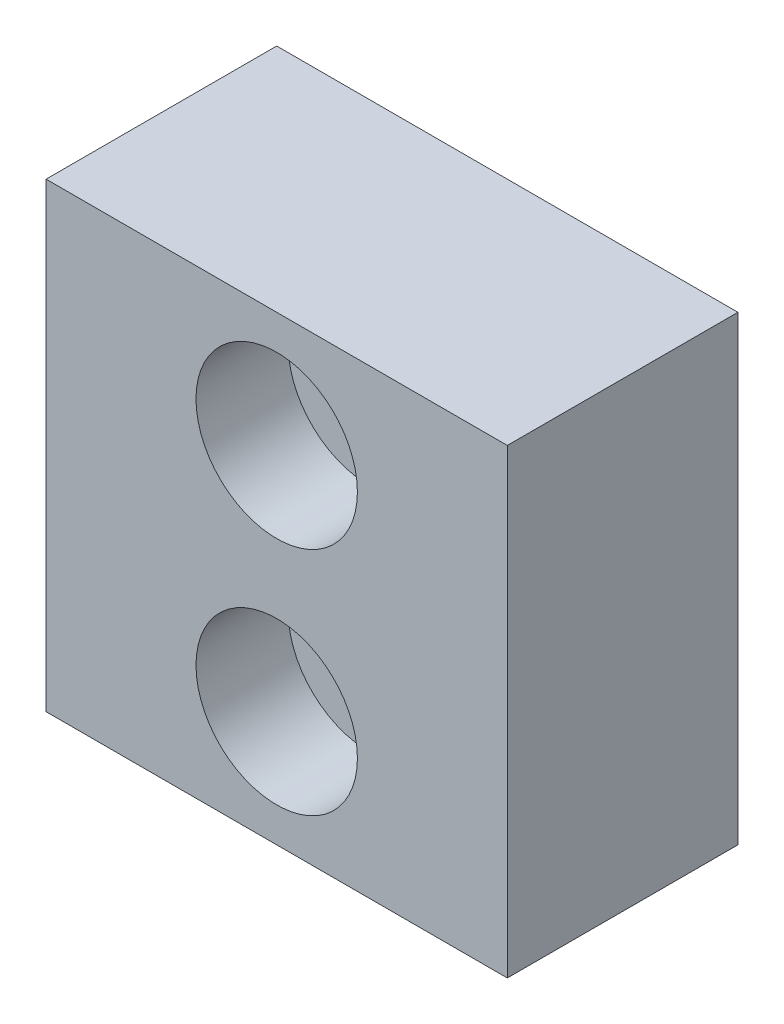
ISO-10303-21;
HEADER;
FILE_DESCRIPTION(('STEP AP214'),'2;1');
FILE_NAME('part.step','',(''),(''),'','','');
FILE_SCHEMA(('AUTOMOTIVE_DESIGN { 1 0 10303 214 1 1 1 1 }'));
ENDSEC;
DATA;
#1=APPLICATION_CONTEXT('core data for automotive mechanical design processes');
#2=APPLICATION_PROTOCOL_DEFINITION('international standard','automotive_design',2000,#1);
#3=PRODUCT_CONTEXT('',#1,'mechanical');
#4=PRODUCT('Part','Part','',(#3));
#5=PRODUCT_RELATED_PRODUCT_CATEGORY('part','',(#4));
#6=PRODUCT_DEFINITION_FORMATION('','',#4);
#7=PRODUCT_DEFINITION_CONTEXT('part definition',#1,'design');
#8=PRODUCT_DEFINITION('design','',#6,#7);
#9=PRODUCT_DEFINITION_SHAPE('','',#8);
#10=(LENGTH_UNIT() NAMED_UNIT(*) SI_UNIT(.MILLI.,.METRE.));
#11=(NAMED_UNIT(*) PLANE_ANGLE_UNIT() SI_UNIT($,.RADIAN.));
#12=(NAMED_UNIT(*) SI_UNIT($,.STERADIAN.) SOLID_ANGLE_UNIT());
#13=UNCERTAINTY_MEASURE_WITH_UNIT(LENGTH_MEASURE(1.E-05),#10,'distance_accuracy_value','');
#14=(GEOMETRIC_REPRESENTATION_CONTEXT(3) GLOBAL_UNCERTAINTY_ASSIGNED_CONTEXT((#13)) GLOBAL_UNIT_ASSIGNED_CONTEXT((#10,
#11,#12)) REPRESENTATION_CONTEXT('',''));
#15=CARTESIAN_POINT('',(0.,0.,0.));
#16=DIRECTION('',(0.,0.,1.));
#17=DIRECTION('',(1.,0.,0.));
#18=AXIS2_PLACEMENT_3D('',#15,#16,#17);
#19=CARTESIAN_POINT('',(0.,-5.,-5.));
#20=DIRECTION('',(0.,0.,1.));
#21=DIRECTION('',(1.,0.,0.));
#22=AXIS2_PLACEMENT_3D('',#19,#20,#21);
#23=CYLINDRICAL_SURFACE('',#22,2.);
#24=CARTESIAN_POINT('',(0.,-5.,-5.));
#25=DIRECTION('',(0.,0.,1.));
#26=DIRECTION('',(1.,0.,0.));
#27=AXIS2_PLACEMENT_3D('',#24,#25,#26);
#28=CIRCLE('',#27,2.);
#29=CARTESIAN_POINT('',(2.,-5.,-5.));
#30=VERTEX_POINT('',#29);
#31=EDGE_CURVE('E122',#30,#30,#28,.T.);
#32=ORIENTED_EDGE('',*,*,#31,.F.);
#33=EDGE_LOOP('',(#32));
#34=FACE_BOUND('',#33,.T.);
#35=CARTESIAN_POINT('',(0.,-5.,1.));
#36=DIRECTION('',(0.,0.,1.));
#37=DIRECTION('',(1.,0.,0.));
#38=AXIS2_PLACEMENT_3D('',#35,#36,#37);
#39=CIRCLE('',#38,2.);
#40=CARTESIAN_POINT('',(2.,-5.,1.));
#41=VERTEX_POINT('',#40);
#42=EDGE_CURVE('E49',#41,#41,#39,.F.);
#43=ORIENTED_EDGE('',*,*,#42,.F.);
#44=EDGE_LOOP('',(#43));
#45=FACE_BOUND('',#44,.T.);
#46=ADVANCED_FACE('F45',(#34,#45),#23,.F.);
#47=CARTESIAN_POINT('',(0.,5.,-5.));
#48=DIRECTION('',(0.,0.,1.));
#49=DIRECTION('',(1.,0.,0.));
#50=AXIS2_PLACEMENT_3D('',#47,#48,#49);
#51=CYLINDRICAL_SURFACE('',#50,2.);
#52=CARTESIAN_POINT('',(0.,5.,-5.));
#53=DIRECTION('',(0.,0.,1.));
#54=DIRECTION('',(1.,0.,0.));
#55=AXIS2_PLACEMENT_3D('',#52,#53,#54);
#56=CIRCLE('',#55,2.);
#57=CARTESIAN_POINT('',(2.,5.,-5.));
#58=VERTEX_POINT('',#57);
#59=EDGE_CURVE('E115',#58,#58,#56,.T.);
#60=ORIENTED_EDGE('',*,*,#59,.F.);
#61=EDGE_LOOP('',(#60));
#62=FACE_BOUND('',#61,.T.);
#63=CARTESIAN_POINT('',(0.,5.,1.));
#64=DIRECTION('',(0.,0.,1.));
#65=DIRECTION('',(1.,0.,0.));
#66=AXIS2_PLACEMENT_3D('',#63,#64,#65);
#67=CIRCLE('',#66,2.);
#68=CARTESIAN_POINT('',(2.,5.,1.));
#69=VERTEX_POINT('',#68);
#70=EDGE_CURVE('E120',#69,#69,#67,.F.);
#71=ORIENTED_EDGE('',*,*,#70,.F.);
#72=EDGE_LOOP('',(#71));
#73=FACE_BOUND('',#72,.T.);
#74=ADVANCED_FACE('F145',(#62,#73),#51,.F.);
#75=CARTESIAN_POINT('',(10.,10.,5.));
#76=DIRECTION('',(-1.,0.,0.));
#77=DIRECTION('',(0.,-1.,0.));
#78=AXIS2_PLACEMENT_3D('',#75,#76,#77);
#79=PLANE('',#78);
#80=DIRECTION('',(0.,1.,0.));
#81=VECTOR('',#80,1.);
#82=CARTESIAN_POINT('',(10.,10.,-5.));
#83=LINE('',#82,#81);
#84=CARTESIAN_POINT('',(10.,-10.,-5.));
#85=VERTEX_POINT('',#84);
#86=CARTESIAN_POINT('',(10.,10.,-5.));
#87=VERTEX_POINT('',#86);
#88=EDGE_CURVE('E112',#85,#87,#83,.T.);
#89=ORIENTED_EDGE('',*,*,#88,.T.);
#90=DIRECTION('',(0.,0.,-1.));
#91=VECTOR('',#90,1.);
#92=CARTESIAN_POINT('',(10.,10.,5.));
#93=LINE('',#92,#91);
#94=CARTESIAN_POINT('',(10.,10.,5.));
#95=VERTEX_POINT('',#94);
#96=EDGE_CURVE('E11',#95,#87,#93,.T.);
#97=ORIENTED_EDGE('',*,*,#96,.F.);
#98=DIRECTION('',(0.,1.,0.));
#99=VECTOR('',#98,1.);
#100=CARTESIAN_POINT('',(10.,10.,5.));
#101=LINE('',#100,#99);
#102=CARTESIAN_POINT('',(10.,-10.,5.));
#103=VERTEX_POINT('',#102);
#104=EDGE_CURVE('E99',#103,#95,#101,.T.);
#105=ORIENTED_EDGE('',*,*,#104,.F.);
#106=DIRECTION('',(0.,0.,-1.));
#107=VECTOR('',#106,1.);
#108=CARTESIAN_POINT('',(10.,-10.,5.));
#109=LINE('',#108,#107);
#110=EDGE_CURVE('E108',#103,#85,#109,.T.);
#111=ORIENTED_EDGE('',*,*,#110,.T.);
#112=EDGE_LOOP('',(#89,#97,#105,#111));
#113=FACE_BOUND('',#112,.T.);
#114=ADVANCED_FACE('F47',(#113),#79,.F.);
#115=CARTESIAN_POINT('',(-10.,10.,5.));
#116=DIRECTION('',(0.,-1.,0.));
#117=DIRECTION('',(0.,0.,-1.));
#118=AXIS2_PLACEMENT_3D('',#115,#116,#117);
#119=PLANE('',#118);
#120=DIRECTION('',(-1.,0.,0.));
#121=VECTOR('',#120,1.);
#122=CARTESIAN_POINT('',(-10.,10.,-5.));
#123=LINE('',#122,#121);
#124=CARTESIAN_POINT('',(-10.,10.,-5.));
#125=VERTEX_POINT('',#124);
#126=EDGE_CURVE('E103',#87,#125,#123,.T.);
#127=ORIENTED_EDGE('',*,*,#126,.T.);
#128=DIRECTION('',(0.,0.,-1.));
#129=VECTOR('',#128,1.);
#130=CARTESIAN_POINT('',(-10.,10.,5.));
#131=LINE('',#130,#129);
#132=CARTESIAN_POINT('',(-10.,10.,5.));
#133=VERTEX_POINT('',#132);
#134=EDGE_CURVE('E55',#133,#125,#131,.T.);
#135=ORIENTED_EDGE('',*,*,#134,.F.);
#136=DIRECTION('',(-1.,0.,0.));
#137=VECTOR('',#136,1.);
#138=CARTESIAN_POINT('',(-10.,10.,5.));
#139=LINE('',#138,#137);
#140=EDGE_CURVE('E94',#95,#133,#139,.T.);
#141=ORIENTED_EDGE('',*,*,#140,.F.);
#142=ORIENTED_EDGE('',*,*,#96,.T.);
#143=EDGE_LOOP('',(#127,#135,#141,#142));
#144=FACE_BOUND('',#143,.T.);
#145=ADVANCED_FACE('F102',(#144),#119,.F.);
#146=CARTESIAN_POINT('',(-10.,10.,5.));
#147=DIRECTION('',(1.,0.,0.));
#148=DIRECTION('',(0.,1.,0.));
#149=AXIS2_PLACEMENT_3D('',#146,#147,#148);
#150=PLANE('',#149);
#151=DIRECTION('',(0.,-1.,0.));
#152=VECTOR('',#151,1.);
#153=CARTESIAN_POINT('',(-10.,10.,-5.));
#154=LINE('',#153,#152);
#155=CARTESIAN_POINT('',(-10.,-10.,-5.));
#156=VERTEX_POINT('',#155);
#157=EDGE_CURVE('E81',#125,#156,#154,.T.);
#158=ORIENTED_EDGE('',*,*,#157,.T.);
#159=DIRECTION('',(0.,0.,-1.));
#160=VECTOR('',#159,1.);
#161=CARTESIAN_POINT('',(-10.,-10.,5.));
#162=LINE('',#161,#160);
#163=CARTESIAN_POINT('',(-10.,-10.,5.));
#164=VERTEX_POINT('',#163);
#165=EDGE_CURVE('E104',#164,#156,#162,.T.);
#166=ORIENTED_EDGE('',*,*,#165,.F.);
#167=DIRECTION('',(0.,-1.,0.));
#168=VECTOR('',#167,1.);
#169=CARTESIAN_POINT('',(-10.,10.,5.));
#170=LINE('',#169,#168);
#171=EDGE_CURVE('E97',#133,#164,#170,.T.);
#172=ORIENTED_EDGE('',*,*,#171,.F.);
#173=ORIENTED_EDGE('',*,*,#134,.T.);
#174=EDGE_LOOP('',(#158,#166,#172,#173));
#175=FACE_BOUND('',#174,.T.);
#176=ADVANCED_FACE('F106',(#175),#150,.F.);
#177=CARTESIAN_POINT('',(-10.,-10.,5.));
#178=DIRECTION('',(0.,1.,0.));
#179=DIRECTION('',(0.,0.,1.));
#180=AXIS2_PLACEMENT_3D('',#177,#178,#179);
#181=PLANE('',#180);
#182=DIRECTION('',(1.,0.,0.));
#183=VECTOR('',#182,1.);
#184=CARTESIAN_POINT('',(-10.,-10.,-5.));
#185=LINE('',#184,#183);
#186=EDGE_CURVE('E87',#156,#85,#185,.T.);
#187=ORIENTED_EDGE('',*,*,#186,.T.);
#188=ORIENTED_EDGE('',*,*,#110,.F.);
#189=DIRECTION('',(1.,0.,0.));
#190=VECTOR('',#189,1.);
#191=CARTESIAN_POINT('',(-10.,-10.,5.));
#192=LINE('',#191,#190);
#193=EDGE_CURVE('E64',#164,#103,#192,.T.);
#194=ORIENTED_EDGE('',*,*,#193,.F.);
#195=ORIENTED_EDGE('',*,*,#165,.T.);
#196=EDGE_LOOP('',(#187,#188,#194,#195));
#197=FACE_BOUND('',#196,.T.);
#198=ADVANCED_FACE('F160',(#197),#181,.F.);
#199=CARTESIAN_POINT('',(0.,0.,5.));
#200=DIRECTION('',(0.,0.,1.));
#201=DIRECTION('',(1.,0.,0.));
#202=AXIS2_PLACEMENT_3D('',#199,#200,#201);
#203=PLANE('',#202);
#204=CARTESIAN_POINT('',(0.,-5.,5.));
#205=DIRECTION('',(0.,0.,1.));
#206=DIRECTION('',(1.,0.,0.));
#207=AXIS2_PLACEMENT_3D('',#204,#205,#206);
#208=CIRCLE('',#207,3.5);
#209=CARTESIAN_POINT('',(3.5,-5.,5.));
#210=VERTEX_POINT('',#209);
#211=EDGE_CURVE('E136',#210,#210,#208,.T.);
#212=ORIENTED_EDGE('',*,*,#211,.F.);
#213=EDGE_LOOP('',(#212));
#214=FACE_BOUND('',#213,.T.);
#215=CARTESIAN_POINT('',(0.,5.,5.));
#216=DIRECTION('',(0.,0.,1.));
#217=DIRECTION('',(1.,0.,0.));
#218=AXIS2_PLACEMENT_3D('',#215,#216,#217);
#219=CIRCLE('',#218,3.5);
#220=CARTESIAN_POINT('',(3.5,5.,5.));
#221=VERTEX_POINT('',#220);
#222=EDGE_CURVE('E129',#221,#221,#219,.T.);
#223=ORIENTED_EDGE('',*,*,#222,.F.);
#224=EDGE_LOOP('',(#223));
#225=FACE_BOUND('',#224,.T.);
#226=ORIENTED_EDGE('',*,*,#104,.T.);
#227=ORIENTED_EDGE('',*,*,#140,.T.);
#228=ORIENTED_EDGE('',*,*,#171,.T.);
#229=ORIENTED_EDGE('',*,*,#193,.T.);
#230=EDGE_LOOP('',(#226,#227,#228,#229));
#231=FACE_BOUND('',#230,.T.);
#232=ADVANCED_FACE('F95',(#214,#225,#231),#203,.T.);
#233=CARTESIAN_POINT('',(0.,0.,-5.));
#234=DIRECTION('',(0.,0.,1.));
#235=DIRECTION('',(1.,0.,0.));
#236=AXIS2_PLACEMENT_3D('',#233,#234,#235);
#237=PLANE('',#236);
#238=ORIENTED_EDGE('',*,*,#31,.T.);
#239=EDGE_LOOP('',(#238));
#240=FACE_BOUND('',#239,.T.);
#241=ORIENTED_EDGE('',*,*,#59,.T.);
#242=EDGE_LOOP('',(#241));
#243=FACE_BOUND('',#242,.T.);
#244=ORIENTED_EDGE('',*,*,#88,.F.);
#245=ORIENTED_EDGE('',*,*,#186,.F.);
#246=ORIENTED_EDGE('',*,*,#157,.F.);
#247=ORIENTED_EDGE('',*,*,#126,.F.);
#248=EDGE_LOOP('',(#244,#245,#246,#247));
#249=FACE_BOUND('',#248,.T.);
#250=ADVANCED_FACE('F142',(#240,#243,#249),#237,.F.);
#251=CARTESIAN_POINT('',(0.,5.,1.));
#252=DIRECTION('',(0.,0.,1.));
#253=DIRECTION('',(1.,0.,0.));
#254=AXIS2_PLACEMENT_3D('',#251,#252,#253);
#255=PLANE('',#254);
#256=CARTESIAN_POINT('',(0.,5.,1.));
#257=DIRECTION('',(0.,0.,1.));
#258=DIRECTION('',(1.,0.,0.));
#259=AXIS2_PLACEMENT_3D('',#256,#257,#258);
#260=CIRCLE('',#259,3.5);
#261=CARTESIAN_POINT('',(3.5,5.,1.));
#262=VERTEX_POINT('',#261);
#263=EDGE_CURVE('E123',#262,#262,#260,.T.);
#264=ORIENTED_EDGE('',*,*,#263,.T.);
#265=EDGE_LOOP('',(#264));
#266=FACE_BOUND('',#265,.T.);
#267=ORIENTED_EDGE('',*,*,#70,.T.);
#268=EDGE_LOOP('',(#267));
#269=FACE_BOUND('',#268,.T.);
#270=ADVANCED_FACE('F164',(#266,#269),#255,.T.);
#271=CARTESIAN_POINT('',(0.,5.,1.));
#272=DIRECTION('',(0.,0.,1.));
#273=DIRECTION('',(1.,0.,0.));
#274=AXIS2_PLACEMENT_3D('',#271,#272,#273);
#275=CYLINDRICAL_SURFACE('',#274,3.5);
#276=ORIENTED_EDGE('',*,*,#263,.F.);
#277=EDGE_LOOP('',(#276));
#278=FACE_BOUND('',#277,.T.);
#279=ORIENTED_EDGE('',*,*,#222,.T.);
#280=EDGE_LOOP('',(#279));
#281=FACE_BOUND('',#280,.T.);
#282=ADVANCED_FACE('F211',(#278,#281),#275,.F.);
#283=CARTESIAN_POINT('',(0.,-5.,1.));
#284=DIRECTION('',(0.,0.,1.));
#285=DIRECTION('',(1.,0.,0.));
#286=AXIS2_PLACEMENT_3D('',#283,#284,#285);
#287=PLANE('',#286);
#288=CARTESIAN_POINT('',(0.,-5.,1.));
#289=DIRECTION('',(0.,0.,1.));
#290=DIRECTION('',(1.,0.,0.));
#291=AXIS2_PLACEMENT_3D('',#288,#289,#290);
#292=CIRCLE('',#291,3.5);
#293=CARTESIAN_POINT('',(3.5,-5.,1.));
#294=VERTEX_POINT('',#293);
#295=EDGE_CURVE('E239',#294,#294,#292,.T.);
#296=ORIENTED_EDGE('',*,*,#295,.T.);
#297=EDGE_LOOP('',(#296));
#298=FACE_BOUND('',#297,.T.);
#299=ORIENTED_EDGE('',*,*,#42,.T.);
#300=EDGE_LOOP('',(#299));
#301=FACE_BOUND('',#300,.T.);
#302=ADVANCED_FACE('F218',(#298,#301),#287,.T.);
#303=CARTESIAN_POINT('',(0.,-5.,1.));
#304=DIRECTION('',(0.,0.,1.));
#305=DIRECTION('',(1.,0.,0.));
#306=AXIS2_PLACEMENT_3D('',#303,#304,#305);
#307=CYLINDRICAL_SURFACE('',#306,3.5);
#308=ORIENTED_EDGE('',*,*,#295,.F.);
#309=EDGE_LOOP('',(#308));
#310=FACE_BOUND('',#309,.T.);
#311=ORIENTED_EDGE('',*,*,#211,.T.);
#312=EDGE_LOOP('',(#311));
#313=FACE_BOUND('',#312,.T.);
#314=ADVANCED_FACE('F225',(#310,#313),#307,.F.);
#315=CLOSED_SHELL('',(#46,#74,#114,#145,#176,#198,#232,#250,#270,#282,#302,#314));
#316=MANIFOLD_SOLID_BREP('B2',#315);
#317=ADVANCED_BREP_SHAPE_REPRESENTATION('',(#18,#316),#14);
#318=SHAPE_DEFINITION_REPRESENTATION(#9,#317);
ENDSEC;
END-ISO-10303-21;
